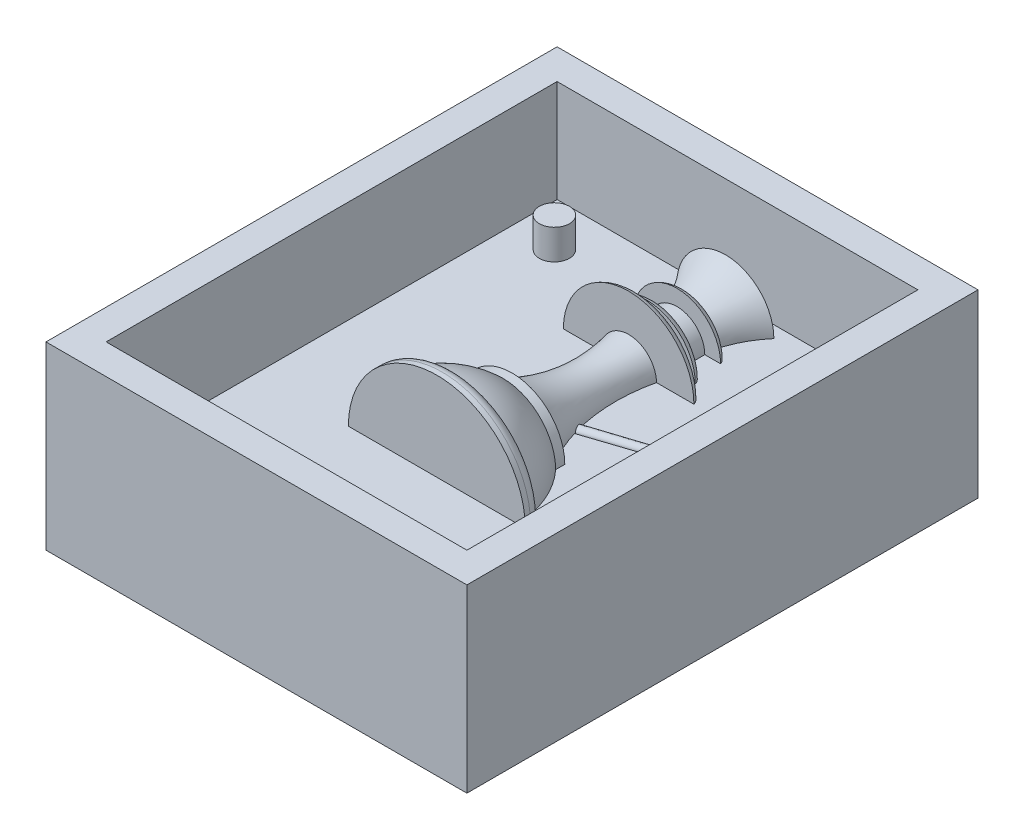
ISO-10303-21;
HEADER;
FILE_DESCRIPTION(('STEP AP214'),'2;1');
FILE_NAME('part.step','',(''),(''),'','','');
FILE_SCHEMA(('AUTOMOTIVE_DESIGN { 1 0 10303 214 1 1 1 1 }'));
ENDSEC;
DATA;
#1=APPLICATION_CONTEXT('core data for automotive mechanical design processes');
#2=APPLICATION_PROTOCOL_DEFINITION('international standard','automotive_design',2000,#1);
#3=PRODUCT_CONTEXT('',#1,'mechanical');
#4=PRODUCT('Part','Part','',(#3));
#5=PRODUCT_RELATED_PRODUCT_CATEGORY('part','',(#4));
#6=PRODUCT_DEFINITION_FORMATION('','',#4);
#7=PRODUCT_DEFINITION_CONTEXT('part definition',#1,'design');
#8=PRODUCT_DEFINITION('design','',#6,#7);
#9=PRODUCT_DEFINITION_SHAPE('','',#8);
#10=(LENGTH_UNIT() NAMED_UNIT(*) SI_UNIT(.MILLI.,.METRE.));
#11=(NAMED_UNIT(*) PLANE_ANGLE_UNIT() SI_UNIT($,.RADIAN.));
#12=(NAMED_UNIT(*) SI_UNIT($,.STERADIAN.) SOLID_ANGLE_UNIT());
#13=UNCERTAINTY_MEASURE_WITH_UNIT(LENGTH_MEASURE(1.E-05),#10,'distance_accuracy_value','');
#14=(GEOMETRIC_REPRESENTATION_CONTEXT(3) GLOBAL_UNCERTAINTY_ASSIGNED_CONTEXT((#13)) GLOBAL_UNIT_ASSIGNED_CONTEXT((#10,
#11,#12)) REPRESENTATION_CONTEXT('',''));
#15=CARTESIAN_POINT('',(0.,0.,0.));
#16=DIRECTION('',(0.,0.,1.));
#17=DIRECTION('',(1.,0.,0.));
#18=AXIS2_PLACEMENT_3D('',#15,#16,#17);
#19=CARTESIAN_POINT('',(0.,13.,0.));
#20=DIRECTION('',(0.,1.,0.));
#21=DIRECTION('',(0.,0.,1.));
#22=AXIS2_PLACEMENT_3D('',#19,#20,#21);
#23=PLANE('',#22);
#24=DIRECTION('',(0.145838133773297,0.,0.989308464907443));
#25=VECTOR('',#24,1.);
#26=CARTESIAN_POINT('',(30.,13.,-14.1966660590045));
#27=LINE('',#26,#25);
#28=CARTESIAN_POINT('',(30.,13.,-14.1966660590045));
#29=VERTEX_POINT('',#28);
#30=CARTESIAN_POINT('',(29.8979133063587,13.,-14.8891819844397));
#31=VERTEX_POINT('',#30);
#32=EDGE_CURVE('E353',#29,#31,#27,.F.);
#33=ORIENTED_EDGE('',*,*,#32,.F.);
#34=DIRECTION('',(0.,0.,-1.));
#35=VECTOR('',#34,1.);
#36=CARTESIAN_POINT('',(30.,13.,37.5));
#37=LINE('',#36,#35);
#38=CARTESIAN_POINT('',(30.,13.,-37.5));
#39=VERTEX_POINT('',#38);
#40=EDGE_CURVE('E349',#29,#39,#37,.T.);
#41=ORIENTED_EDGE('',*,*,#40,.T.);
#42=DIRECTION('',(-1.,0.,0.));
#43=VECTOR('',#42,1.);
#44=CARTESIAN_POINT('',(30.,13.,-37.5));
#45=LINE('',#44,#43);
#46=CARTESIAN_POINT('',(1.76,13.,-37.5));
#47=VERTEX_POINT('',#46);
#48=EDGE_CURVE('E964',#39,#47,#45,.T.);
#49=ORIENTED_EDGE('',*,*,#48,.T.);
#50=DIRECTION('',(0.,0.,-1.));
#51=VECTOR('',#50,1.);
#52=CARTESIAN_POINT('',(1.76,13.,-42.5));
#53=LINE('',#52,#51);
#54=CARTESIAN_POINT('',(1.76,13.,-35.5));
#55=VERTEX_POINT('',#54);
#56=EDGE_CURVE('E313',#47,#55,#53,.F.);
#57=ORIENTED_EDGE('',*,*,#56,.T.);
#58=DIRECTION('',(1.,0.,0.));
#59=VECTOR('',#58,1.);
#60=CARTESIAN_POINT('',(0.,13.,-35.5));
#61=LINE('',#60,#59);
#62=CARTESIAN_POINT('',(8.05528343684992,13.,-35.5));
#63=VERTEX_POINT('',#62);
#64=EDGE_CURVE('E311',#55,#63,#61,.T.);
#65=ORIENTED_EDGE('',*,*,#64,.T.);
#66=CARTESIAN_POINT('',(20.2084994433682,13.,-25.062448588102));
#67=DIRECTION('',(0.,1.,0.));
#68=DIRECTION('',(0.,0.,1.));
#69=AXIS2_PLACEMENT_3D('',#66,#67,#68);
#70=CIRCLE('',#69,16.0200854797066);
#71=CARTESIAN_POINT('',(4.62528343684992,13.,-28.7781608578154));
#72=VERTEX_POINT('',#71);
#73=EDGE_CURVE('E308',#63,#72,#70,.T.);
#74=ORIENTED_EDGE('',*,*,#73,.T.);
#75=DIRECTION('',(1.,0.,0.));
#76=VECTOR('',#75,1.);
#77=CARTESIAN_POINT('',(0.,13.,-28.7781608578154));
#78=LINE('',#77,#76);
#79=CARTESIAN_POINT('',(5.35732157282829,13.,-28.7781608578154));
#80=VERTEX_POINT('',#79);
#81=EDGE_CURVE('E312',#72,#80,#78,.T.);
#82=ORIENTED_EDGE('',*,*,#81,.T.);
#83=CARTESIAN_POINT('',(5.35732157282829,13.,-26.7781608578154));
#84=DIRECTION('',(0.,1.,0.));
#85=DIRECTION('',(0.,0.,1.));
#86=AXIS2_PLACEMENT_3D('',#83,#84,#85);
#87=CIRCLE('',#86,2.);
#88=CARTESIAN_POINT('',(7.24528343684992,13.,-27.4381608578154));
#89=VERTEX_POINT('',#88);
#90=EDGE_CURVE('E56',#80,#89,#87,.F.);
#91=ORIENTED_EDGE('',*,*,#90,.T.);
#92=DIRECTION('',(-1.,0.,0.));
#93=VECTOR('',#92,1.);
#94=CARTESIAN_POINT('',(0.,13.,-27.4381608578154));
#95=LINE('',#94,#93);
#96=CARTESIAN_POINT('',(4.62528343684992,13.,-27.4381608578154));
#97=VERTEX_POINT('',#96);
#98=EDGE_CURVE('E306',#89,#97,#95,.T.);
#99=ORIENTED_EDGE('',*,*,#98,.T.);
#100=DIRECTION('',(0.,0.,-1.));
#101=VECTOR('',#100,1.);
#102=CARTESIAN_POINT('',(4.62528343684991,13.,-42.5));
#103=LINE('',#102,#101);
#104=CARTESIAN_POINT('',(4.62528343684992,13.,-23.8581608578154));
#105=VERTEX_POINT('',#104);
#106=EDGE_CURVE('E303',#97,#105,#103,.F.);
#107=ORIENTED_EDGE('',*,*,#106,.T.);
#108=DIRECTION('',(1.,0.,0.));
#109=VECTOR('',#108,1.);
#110=CARTESIAN_POINT('',(0.,13.,-23.8581608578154));
#111=LINE('',#110,#109);
#112=CARTESIAN_POINT('',(6.13822840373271,13.,-23.8581608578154));
#113=VERTEX_POINT('',#112);
#114=EDGE_CURVE('E307',#105,#113,#111,.T.);
#115=ORIENTED_EDGE('',*,*,#114,.T.);
#116=CARTESIAN_POINT('',(6.13822840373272,13.,-21.8581608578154));
#117=DIRECTION('',(0.,1.,0.));
#118=DIRECTION('',(0.,0.,1.));
#119=AXIS2_PLACEMENT_3D('',#116,#117,#118);
#120=CIRCLE('',#119,2.);
#121=CARTESIAN_POINT('',(8.05528343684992,13.,-22.4281608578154));
#122=VERTEX_POINT('',#121);
#123=EDGE_CURVE('E334',#113,#122,#120,.F.);
#124=ORIENTED_EDGE('',*,*,#123,.T.);
#125=DIRECTION('',(-1.,0.,0.));
#126=VECTOR('',#125,1.);
#127=CARTESIAN_POINT('',(0.,13.,-22.4281608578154));
#128=LINE('',#127,#126);
#129=CARTESIAN_POINT('',(4.62528343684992,13.,-22.4281608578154));
#130=VERTEX_POINT('',#129);
#131=EDGE_CURVE('E302',#122,#130,#128,.T.);
#132=ORIENTED_EDGE('',*,*,#131,.T.);
#133=DIRECTION('',(0.,0.,-1.));
#134=VECTOR('',#133,1.);
#135=CARTESIAN_POINT('',(4.62528343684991,13.,-42.5));
#136=LINE('',#135,#134);
#137=CARTESIAN_POINT('',(4.62528343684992,13.,-20.8281608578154));
#138=VERTEX_POINT('',#137);
#139=EDGE_CURVE('E299',#130,#138,#136,.F.);
#140=ORIENTED_EDGE('',*,*,#139,.T.);
#141=DIRECTION('',(1.,0.,0.));
#142=VECTOR('',#141,1.);
#143=CARTESIAN_POINT('',(0.,13.,-20.8281608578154));
#144=LINE('',#143,#142);
#145=CARTESIAN_POINT('',(8.93822840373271,13.,-20.8281608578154));
#146=VERTEX_POINT('',#145);
#147=EDGE_CURVE('E292',#138,#146,#144,.T.);
#148=ORIENTED_EDGE('',*,*,#147,.T.);
#149=CARTESIAN_POINT('',(8.93822840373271,13.,-18.8281608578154));
#150=DIRECTION('',(0.,1.,0.));
#151=DIRECTION('',(0.,0.,1.));
#152=AXIS2_PLACEMENT_3D('',#149,#150,#151);
#153=CIRCLE('',#152,2.);
#154=CARTESIAN_POINT('',(10.8552834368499,13.,-19.3981608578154));
#155=VERTEX_POINT('',#154);
#156=EDGE_CURVE('E330',#146,#155,#153,.F.);
#157=ORIENTED_EDGE('',*,*,#156,.T.);
#158=DIRECTION('',(-1.,0.,0.));
#159=VECTOR('',#158,1.);
#160=CARTESIAN_POINT('',(0.,13.,-19.3981608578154));
#161=LINE('',#160,#159);
#162=CARTESIAN_POINT('',(4.62528343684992,13.,-19.3981608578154));
#163=VERTEX_POINT('',#162);
#164=EDGE_CURVE('E291',#155,#163,#161,.T.);
#165=ORIENTED_EDGE('',*,*,#164,.T.);
#166=CARTESIAN_POINT('',(31.5891164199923,13.,-13.3029481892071));
#167=DIRECTION('',(0.,1.,0.));
#168=DIRECTION('',(0.,0.,1.));
#169=AXIS2_PLACEMENT_3D('',#166,#167,#168);
#170=CIRCLE('',#169,27.6441658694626);
#171=CARTESIAN_POINT('',(4.93175809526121,13.,-5.9827600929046));
#172=VERTEX_POINT('',#171);
#173=EDGE_CURVE('E282',#163,#172,#170,.T.);
#174=ORIENTED_EDGE('',*,*,#173,.T.);
#175=DIRECTION('',(0.218026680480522,0.,0.975942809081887));
#176=VECTOR('',#175,1.);
#177=CARTESIAN_POINT('',(4.93175809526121,13.,-5.9827600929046));
#178=LINE('',#177,#176);
#179=CARTESIAN_POINT('',(4.76509412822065,13.,-6.72879034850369));
#180=VERTEX_POINT('',#179);
#181=EDGE_CURVE('E41',#180,#172,#178,.T.);
#182=ORIENTED_EDGE('',*,*,#181,.F.);
#183=DIRECTION('',(-0.95112051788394,0.,0.308819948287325));
#184=VECTOR('',#183,1.);
#185=CARTESIAN_POINT('',(274.234734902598,13.,-94.2230657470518));
#186=LINE('',#185,#184);
#187=EDGE_CURVE('E357',#31,#180,#186,.T.);
#188=ORIENTED_EDGE('',*,*,#187,.F.);
#189=EDGE_LOOP('',(#33,#41,#49,#57,#65,#74,#82,#91,#99,#107,#115,#124,#132,#140,#148,#157,#165,
#174,#182,#188));
#190=FACE_BOUND('',#189,.T.);
#191=ADVANCED_FACE('F33',(#190),#23,.T.);
#192=CARTESIAN_POINT('',(0.,0.,0.));
#193=DIRECTION('',(0.,1.,0.));
#194=DIRECTION('',(0.,0.,1.));
#195=AXIS2_PLACEMENT_3D('',#192,#193,#194);
#196=PLANE('',#195);
#197=DIRECTION('',(0.,0.,-1.));
#198=VECTOR('',#197,1.);
#199=CARTESIAN_POINT('',(35.,0.,-42.5));
#200=LINE('',#199,#198);
#201=CARTESIAN_POINT('',(35.,0.,42.5));
#202=VERTEX_POINT('',#201);
#203=CARTESIAN_POINT('',(35.,0.,-42.5));
#204=VERTEX_POINT('',#203);
#205=EDGE_CURVE('E490',#202,#204,#200,.T.);
#206=ORIENTED_EDGE('',*,*,#205,.F.);
#207=DIRECTION('',(1.,0.,0.));
#208=VECTOR('',#207,1.);
#209=CARTESIAN_POINT('',(-35.,0.,42.5));
#210=LINE('',#209,#208);
#211=CARTESIAN_POINT('',(-35.,0.,42.5));
#212=VERTEX_POINT('',#211);
#213=EDGE_CURVE('E861',#212,#202,#210,.T.);
#214=ORIENTED_EDGE('',*,*,#213,.F.);
#215=DIRECTION('',(0.,0.,1.));
#216=VECTOR('',#215,1.);
#217=CARTESIAN_POINT('',(-35.,0.,-42.5));
#218=LINE('',#217,#216);
#219=CARTESIAN_POINT('',(-35.,0.,-42.5));
#220=VERTEX_POINT('',#219);
#221=EDGE_CURVE('E852',#220,#212,#218,.T.);
#222=ORIENTED_EDGE('',*,*,#221,.F.);
#223=DIRECTION('',(-1.,0.,0.));
#224=VECTOR('',#223,1.);
#225=CARTESIAN_POINT('',(-35.,0.,-42.5));
#226=LINE('',#225,#224);
#227=EDGE_CURVE('E849',#204,#220,#226,.T.);
#228=ORIENTED_EDGE('',*,*,#227,.F.);
#229=EDGE_LOOP('',(#206,#214,#222,#228));
#230=FACE_BOUND('',#229,.T.);
#231=DIRECTION('',(-1.,0.,0.));
#232=VECTOR('',#231,1.);
#233=CARTESIAN_POINT('',(0.,0.,12.5));
#234=LINE('',#233,#232);
#235=CARTESIAN_POINT('',(6.8889816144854,0.,12.5));
#236=VERTEX_POINT('',#235);
#237=CARTESIAN_POINT('',(-6.8889816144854,0.,12.5));
#238=VERTEX_POINT('',#237);
#239=EDGE_CURVE('E492',#236,#238,#234,.T.);
#240=ORIENTED_EDGE('',*,*,#239,.F.);
#241=DIRECTION('',(0.,0.,-1.));
#242=VECTOR('',#241,1.);
#243=CARTESIAN_POINT('',(6.88898161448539,0.,-42.5));
#244=LINE('',#243,#242);
#245=CARTESIAN_POINT('',(6.8889816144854,0.,9.6367311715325));
#246=VERTEX_POINT('',#245);
#247=EDGE_CURVE('E494',#246,#236,#244,.F.);
#248=ORIENTED_EDGE('',*,*,#247,.F.);
#249=DIRECTION('',(1.,0.,0.));
#250=VECTOR('',#249,1.);
#251=CARTESIAN_POINT('',(0.,0.,9.63673117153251));
#252=LINE('',#251,#250);
#253=CARTESIAN_POINT('',(1.28522039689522,0.,9.6367311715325));
#254=VERTEX_POINT('',#253);
#255=EDGE_CURVE('E421',#254,#246,#252,.T.);
#256=ORIENTED_EDGE('',*,*,#255,.F.);
#257=CARTESIAN_POINT('',(0.,0.,9.36666581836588));
#258=CARTESIAN_POINT('',(0.192582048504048,0.,9.36668142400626));
#259=CARTESIAN_POINT('',(0.385426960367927,0.,9.38439830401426));
#260=CARTESIAN_POINT('',(0.764982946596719,0.,9.4543302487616));
#261=CARTESIAN_POINT('',(0.951680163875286,0.,9.50661830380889));
#262=CARTESIAN_POINT('',(1.31234993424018,0.,9.64259346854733));
#263=CARTESIAN_POINT('',(1.48637032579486,0.,9.72615435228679));
#264=CARTESIAN_POINT('',(1.81815137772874,0.,9.92070220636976));
#265=CARTESIAN_POINT('',(1.975915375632,0.,10.0316835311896));
#266=CARTESIAN_POINT('',(2.27483005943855,0.,10.2788012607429));
#267=CARTESIAN_POINT('',(2.41564851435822,0.,10.4153373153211));
#268=CARTESIAN_POINT('',(2.67549395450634,0.,10.7077113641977));
#269=CARTESIAN_POINT('',(2.79451412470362,0.,10.8635553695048));
#270=CARTESIAN_POINT('',(3.02329316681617,0.,11.2111819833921));
#271=CARTESIAN_POINT('',(3.12993816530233,0.,11.4050134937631));
#272=CARTESIAN_POINT('',(3.31312290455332,0.,11.8064089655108));
#273=CARTESIAN_POINT('',(3.38964621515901,0.,12.0139803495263));
#274=CARTESIAN_POINT('',(3.51935866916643,0.,12.462972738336));
#275=CARTESIAN_POINT('',(3.5687342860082,0.,12.7054997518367));
#276=CARTESIAN_POINT('',(3.62905168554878,0.,13.1953104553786));
#277=CARTESIAN_POINT('',(3.63997750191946,0.,13.4425960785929));
#278=CARTESIAN_POINT('',(3.62273212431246,0.,13.9533410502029));
#279=CARTESIAN_POINT('',(3.59174946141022,0.,14.2167111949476));
#280=CARTESIAN_POINT('',(3.4857510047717,0.,14.7345569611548));
#281=CARTESIAN_POINT('',(3.41072538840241,0.,14.9890305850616));
#282=CARTESIAN_POINT('',(3.21784308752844,0.,15.4791166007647));
#283=CARTESIAN_POINT('',(3.10031301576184,0.,15.7148565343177));
#284=CARTESIAN_POINT('',(2.82354595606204,0.,16.1606021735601));
#285=CARTESIAN_POINT('',(2.66432882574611,0.,16.370620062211));
#286=CARTESIAN_POINT('',(2.32346245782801,0.,16.7371135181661));
#287=CARTESIAN_POINT('',(2.14520714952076,0.,16.8967323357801));
#288=CARTESIAN_POINT('',(1.760818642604,0.,17.1778895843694));
#289=CARTESIAN_POINT('',(1.55472154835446,0.,17.2994766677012));
#290=CARTESIAN_POINT('',(1.15167511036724,0.,17.4829650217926));
#291=CARTESIAN_POINT('',(0.957427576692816,0.,17.5508087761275));
#292=CARTESIAN_POINT('',(0.55961252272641,0.,17.6484166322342));
#293=CARTESIAN_POINT('',(0.356053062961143,0.,17.6782130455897));
#294=CARTESIAN_POINT('',(-0.0306959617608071,0.,17.6968094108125));
#295=CARTESIAN_POINT('',(-0.213699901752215,0.,17.6897058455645));
#296=CARTESIAN_POINT('',(-0.575739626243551,0.,17.6441930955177));
#297=CARTESIAN_POINT('',(-0.754776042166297,0.,17.6057889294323));
#298=CARTESIAN_POINT('',(-1.10048109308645,0.,17.5006450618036));
#299=CARTESIAN_POINT('',(-1.26732133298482,0.,17.4344643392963));
#300=CARTESIAN_POINT('',(-1.58851058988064,0.,17.2767571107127));
#301=CARTESIAN_POINT('',(-1.74285700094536,0.,17.1852253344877));
#302=CARTESIAN_POINT('',(-2.04607388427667,0.,16.9733009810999));
#303=CARTESIAN_POINT('',(-2.19387034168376,0.,16.8513766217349));
#304=CARTESIAN_POINT('',(-2.46956632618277,0.,16.5868451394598));
#305=CARTESIAN_POINT('',(-2.59745751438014,0.,16.4442293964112));
#306=CARTESIAN_POINT('',(-2.84566286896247,0.,16.1246423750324));
#307=CARTESIAN_POINT('',(-2.96331241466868,0.,15.9456031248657));
#308=CARTESIAN_POINT('',(-3.1707364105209,0.,15.5720740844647));
#309=CARTESIAN_POINT('',(-3.26049725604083,0.,15.3775768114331));
#310=CARTESIAN_POINT('',(-3.42090730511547,0.,14.9530371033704));
#311=CARTESIAN_POINT('',(-3.48781113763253,0.,14.7215762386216));
#312=CARTESIAN_POINT('',(-3.58527835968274,0.,14.251112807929));
#313=CARTESIAN_POINT('',(-3.61582491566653,0.,14.0121068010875));
#314=CARTESIAN_POINT('',(-3.64149301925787,0.,13.5113675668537));
#315=CARTESIAN_POINT('',(-3.63331609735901,0.,13.2494593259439));
#316=CARTESIAN_POINT('',(-3.57387396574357,0.,12.7304885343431));
#317=CARTESIAN_POINT('',(-3.52259596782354,0.,12.4734274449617));
#318=CARTESIAN_POINT('',(-3.3761000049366,0.,11.9678637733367));
#319=CARTESIAN_POINT('',(-3.28023831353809,0.,11.7195459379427));
#320=CARTESIAN_POINT('',(-3.04511476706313,0.,11.2442257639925));
#321=CARTESIAN_POINT('',(-2.90586495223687,0.,11.0172175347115));
#322=CARTESIAN_POINT('',(-2.59734140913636,0.,10.6094223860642));
#323=CARTESIAN_POINT('',(-2.4309100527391,0.,10.4264956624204));
#324=CARTESIAN_POINT('',(-2.06548885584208,0.,10.0964421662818));
#325=CARTESIAN_POINT('',(-1.86652339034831,0.,9.94928879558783));
#326=CARTESIAN_POINT('',(-1.47021709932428,0.,9.71649137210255));
#327=CARTESIAN_POINT('',(-1.2761373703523,0.,9.62528819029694));
#328=CARTESIAN_POINT('',(-0.874284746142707,0.,9.48229022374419));
#329=CARTESIAN_POINT('',(-0.666557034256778,0.,9.43037188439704));
#330=CARTESIAN_POINT('',(-0.380579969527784,0.,9.38872461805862));
#331=CARTESIAN_POINT('',(-0.304715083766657,0.,9.38046545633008));
#332=CARTESIAN_POINT('',(-0.152580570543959,0.,9.36943282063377));
#333=CARTESIAN_POINT('',(-0.0763109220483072,0.,9.36665963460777));
#334=CARTESIAN_POINT('',(0.,0.,9.36666581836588));
#335=B_SPLINE_CURVE_WITH_KNOTS('',3,(#257,#258,#259,#260,#261,#262,#263,#264,#265,#266,#267,
#268,#269,#270,#271,#272,#273,#274,#275,#276,#277,#278,#279,#280,#281,#282,#283,#284,#285,#286,
#287,#288,#289,#290,#291,#292,#293,#294,#295,#296,#297,#298,#299,#300,#301,#302,#303,#304,#305,
#306,#307,#308,#309,#310,#311,#312,#313,#314,#315,#316,#317,#318,#319,#320,#321,#322,#323,#324,
#325,#326,#327,#328,#329,#330,#331,#332,#333,#334),.UNSPECIFIED.,.T.,.F.,(4,2,2,2,2,2,2,2,2,2,2,
2,2,2,2,2,2,2,2,2,2,2,2,2,2,2,2,2,2,2,2,2,2,2,2,2,2,2,4),(0.,0.577410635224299,1.15604427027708,
1.73236713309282,2.30857143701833,2.89468146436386,3.48097442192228,4.14199362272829,
4.80337288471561,5.54270834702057,6.28235078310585,7.07415303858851,7.8661319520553,
8.65215013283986,9.43779457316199,10.1514248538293,10.8641384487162,11.4779130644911,
12.0911660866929,12.6378964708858,13.184539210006,13.7206721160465,14.2569165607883,
14.8293808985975,15.4020844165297,16.0422117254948,16.6826508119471,17.4024325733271,
18.1225474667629,18.9050522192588,19.6877892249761,20.4821964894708,21.2763835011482,
22.0140443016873,22.7511549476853,23.3908400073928,24.0285047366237,24.2572925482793,
24.4860923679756),.UNSPECIFIED.);
#336=CARTESIAN_POINT('',(-1.28522039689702,0.,9.63673117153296));
#337=VERTEX_POINT('',#336);
#338=EDGE_CURVE('E414',#337,#254,#335,.T.);
#339=ORIENTED_EDGE('',*,*,#338,.F.);
#340=CARTESIAN_POINT('',(-6.8889816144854,0.,9.63673117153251));
#341=VERTEX_POINT('',#340);
#342=EDGE_CURVE('E1002',#341,#337,#252,.T.);
#343=ORIENTED_EDGE('',*,*,#342,.F.);
#344=DIRECTION('',(0.,0.,-1.));
#345=VECTOR('',#344,1.);
#346=CARTESIAN_POINT('',(-6.88898161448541,0.,-42.5));
#347=LINE('',#346,#345);
#348=EDGE_CURVE('E497',#238,#341,#347,.T.);
#349=ORIENTED_EDGE('',*,*,#348,.F.);
#350=EDGE_LOOP('',(#240,#248,#256,#339,#343,#349));
#351=FACE_BOUND('',#350,.T.);
#352=ADVANCED_FACE('F423',(#230,#351),#196,.F.);
#353=CARTESIAN_POINT('',(23.,13.,30.5));
#354=DIRECTION('',(0.,1.,0.));
#355=DIRECTION('',(0.,0.,1.));
#356=AXIS2_PLACEMENT_3D('',#353,#354,#355);
#357=CIRCLE('',#356,2.5);
#358=CARTESIAN_POINT('',(23.,13.,33.));
#359=VERTEX_POINT('',#358);
#360=EDGE_CURVE('E1031',#359,#359,#357,.T.);
#361=ORIENTED_EDGE('',*,*,#360,.F.);
#362=EDGE_LOOP('',(#361));
#363=FACE_BOUND('',#362,.T.);
#364=CARTESIAN_POINT('',(-23.,13.,-30.0513648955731));
#365=DIRECTION('',(0.,1.,0.));
#366=DIRECTION('',(0.,0.,1.));
#367=AXIS2_PLACEMENT_3D('',#364,#365,#366);
#368=CIRCLE('',#367,2.5);
#369=CARTESIAN_POINT('',(-23.,13.,-27.5513648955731));
#370=VERTEX_POINT('',#369);
#371=EDGE_CURVE('E1030',#370,#370,#368,.T.);
#372=ORIENTED_EDGE('',*,*,#371,.F.);
#373=EDGE_LOOP('',(#372));
#374=FACE_BOUND('',#373,.T.);
#375=DIRECTION('',(0.949448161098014,0.,-0.313923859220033));
#376=VECTOR('',#375,1.);
#377=CARTESIAN_POINT('',(274.234734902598,13.,-94.2230657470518));
#378=LINE('',#377,#376);
#379=CARTESIAN_POINT('',(5.23890304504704,13.,-5.2827600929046));
#380=VERTEX_POINT('',#379);
#381=CARTESIAN_POINT('',(30.,13.,-13.469725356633));
#382=VERTEX_POINT('',#381);
#383=EDGE_CURVE('E48',#380,#382,#378,.T.);
#384=ORIENTED_EDGE('',*,*,#383,.F.);
#385=DIRECTION('',(0.401801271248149,0.,0.915726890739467));
#386=VECTOR('',#385,1.);
#387=CARTESIAN_POINT('',(4.93175809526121,13.,-5.9827600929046));
#388=LINE('',#387,#386);
#389=EDGE_CURVE('E11',#172,#380,#388,.T.);
#390=ORIENTED_EDGE('',*,*,#389,.F.);
#391=CARTESIAN_POINT('',(7.35625699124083,13.,0.));
#392=VERTEX_POINT('',#391);
#393=EDGE_CURVE('E275',#172,#392,#170,.T.);
#394=ORIENTED_EDGE('',*,*,#393,.T.);
#395=DIRECTION('',(1.,0.,0.));
#396=VECTOR('',#395,1.);
#397=CARTESIAN_POINT('',(0.,13.,0.));
#398=LINE('',#397,#396);
#399=CARTESIAN_POINT('',(8.7791536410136,13.,0.));
#400=VERTEX_POINT('',#399);
#401=EDGE_CURVE('E286',#392,#400,#398,.T.);
#402=ORIENTED_EDGE('',*,*,#401,.T.);
#403=DIRECTION('',(0.,0.,-1.));
#404=VECTOR('',#403,1.);
#405=CARTESIAN_POINT('',(8.77915364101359,13.,-42.5));
#406=LINE('',#405,#404);
#407=CARTESIAN_POINT('',(8.7791536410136,13.,1.52405486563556));
#408=VERTEX_POINT('',#407);
#409=EDGE_CURVE('E297',#400,#408,#406,.F.);
#410=ORIENTED_EDGE('',*,*,#409,.T.);
#411=CARTESIAN_POINT('',(-4.13068325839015,13.,13.5291745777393));
#412=DIRECTION('',(0.,1.,0.));
#413=DIRECTION('',(0.,0.,1.));
#414=AXIS2_PLACEMENT_3D('',#411,#412,#413);
#415=CIRCLE('',#414,17.6291459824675);
#416=CARTESIAN_POINT('',(13.0633759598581,13.,9.6367311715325));
#417=VERTEX_POINT('',#416);
#418=EDGE_CURVE('E919',#408,#417,#415,.F.);
#419=ORIENTED_EDGE('',*,*,#418,.T.);
#420=CARTESIAN_POINT('',(12.7125139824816,13.,11.6057146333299));
#421=DIRECTION('',(0.,1.,0.));
#422=DIRECTION('',(0.,0.,1.));
#423=AXIS2_PLACEMENT_3D('',#420,#421,#422);
#424=CIRCLE('',#423,2.);
#425=CARTESIAN_POINT('',(14.7125139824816,13.,11.6057146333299));
#426=VERTEX_POINT('',#425);
#427=EDGE_CURVE('E318',#417,#426,#424,.F.);
#428=ORIENTED_EDGE('',*,*,#427,.T.);
#429=DIRECTION('',(0.,0.,-1.));
#430=VECTOR('',#429,1.);
#431=CARTESIAN_POINT('',(14.7125139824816,13.,-42.5));
#432=LINE('',#431,#430);
#433=CARTESIAN_POINT('',(14.7125139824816,13.,12.5));
#434=VERTEX_POINT('',#433);
#435=EDGE_CURVE('E918',#426,#434,#432,.F.);
#436=ORIENTED_EDGE('',*,*,#435,.T.);
#437=DIRECTION('',(-1.,0.,0.));
#438=VECTOR('',#437,1.);
#439=CARTESIAN_POINT('',(0.,13.,12.5));
#440=LINE('',#439,#438);
#441=CARTESIAN_POINT('',(-14.7125139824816,13.,12.5));
#442=VERTEX_POINT('',#441);
#443=EDGE_CURVE('E915',#434,#442,#440,.T.);
#444=ORIENTED_EDGE('',*,*,#443,.T.);
#445=DIRECTION('',(0.,0.,-1.));
#446=VECTOR('',#445,1.);
#447=CARTESIAN_POINT('',(-14.7125139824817,13.,-42.5));
#448=LINE('',#447,#446);
#449=CARTESIAN_POINT('',(-14.7125139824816,13.,11.6057146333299));
#450=VERTEX_POINT('',#449);
#451=EDGE_CURVE('E912',#442,#450,#448,.T.);
#452=ORIENTED_EDGE('',*,*,#451,.T.);
#453=CARTESIAN_POINT('',(-12.7125139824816,13.,11.6057146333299));
#454=DIRECTION('',(0.,1.,0.));
#455=DIRECTION('',(0.,0.,1.));
#456=AXIS2_PLACEMENT_3D('',#453,#454,#455);
#457=CIRCLE('',#456,2.);
#458=CARTESIAN_POINT('',(-13.0633759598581,13.,9.6367311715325));
#459=VERTEX_POINT('',#458);
#460=EDGE_CURVE('E320',#450,#459,#457,.F.);
#461=ORIENTED_EDGE('',*,*,#460,.T.);
#462=CARTESIAN_POINT('',(4.13068325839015,13.,13.5291745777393));
#463=DIRECTION('',(0.,1.,0.));
#464=DIRECTION('',(0.,0.,1.));
#465=AXIS2_PLACEMENT_3D('',#462,#463,#464);
#466=CIRCLE('',#465,17.6291459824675);
#467=CARTESIAN_POINT('',(-8.77915364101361,13.,1.52405486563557));
#468=VERTEX_POINT('',#467);
#469=EDGE_CURVE('E909',#459,#468,#466,.F.);
#470=ORIENTED_EDGE('',*,*,#469,.T.);
#471=DIRECTION('',(0.,0.,-1.));
#472=VECTOR('',#471,1.);
#473=CARTESIAN_POINT('',(-8.77915364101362,13.,-42.5));
#474=LINE('',#473,#472);
#475=CARTESIAN_POINT('',(-8.77915364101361,13.,0.));
#476=VERTEX_POINT('',#475);
#477=EDGE_CURVE('E906',#468,#476,#474,.T.);
#478=ORIENTED_EDGE('',*,*,#477,.T.);
#479=CARTESIAN_POINT('',(-7.35625699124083,13.,0.));
#480=VERTEX_POINT('',#479);
#481=EDGE_CURVE('E903',#476,#480,#398,.T.);
#482=ORIENTED_EDGE('',*,*,#481,.T.);
#483=CARTESIAN_POINT('',(-31.5891164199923,13.,-13.3029481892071));
#484=DIRECTION('',(0.,1.,0.));
#485=DIRECTION('',(0.,0.,1.));
#486=AXIS2_PLACEMENT_3D('',#483,#484,#485);
#487=CIRCLE('',#486,27.6441658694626);
#488=CARTESIAN_POINT('',(-4.62528343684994,13.,-19.3981608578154));
#489=VERTEX_POINT('',#488);
#490=EDGE_CURVE('E900',#480,#489,#487,.T.);
#491=ORIENTED_EDGE('',*,*,#490,.T.);
#492=CARTESIAN_POINT('',(-10.8552834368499,13.,-19.3981608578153));
#493=VERTEX_POINT('',#492);
#494=EDGE_CURVE('E294',#489,#493,#161,.T.);
#495=ORIENTED_EDGE('',*,*,#494,.T.);
#496=CARTESIAN_POINT('',(-8.93822840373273,13.,-18.8281608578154));
#497=DIRECTION('',(0.,1.,0.));
#498=DIRECTION('',(0.,0.,1.));
#499=AXIS2_PLACEMENT_3D('',#496,#497,#498);
#500=CIRCLE('',#499,2.);
#501=CARTESIAN_POINT('',(-8.93822840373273,13.,-20.8281608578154));
#502=VERTEX_POINT('',#501);
#503=EDGE_CURVE('E332',#493,#502,#500,.F.);
#504=ORIENTED_EDGE('',*,*,#503,.T.);
#505=CARTESIAN_POINT('',(-4.62528343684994,13.,-20.8281608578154));
#506=VERTEX_POINT('',#505);
#507=EDGE_CURVE('E897',#502,#506,#144,.T.);
#508=ORIENTED_EDGE('',*,*,#507,.T.);
#509=DIRECTION('',(0.,0.,-1.));
#510=VECTOR('',#509,1.);
#511=CARTESIAN_POINT('',(-4.62528343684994,13.,-42.5));
#512=LINE('',#511,#510);
#513=CARTESIAN_POINT('',(-4.62528343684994,13.,-22.4281608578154));
#514=VERTEX_POINT('',#513);
#515=EDGE_CURVE('E894',#506,#514,#512,.T.);
#516=ORIENTED_EDGE('',*,*,#515,.T.);
#517=CARTESIAN_POINT('',(-8.05528343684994,13.,-22.4281608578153));
#518=VERTEX_POINT('',#517);
#519=EDGE_CURVE('E891',#514,#518,#128,.T.);
#520=ORIENTED_EDGE('',*,*,#519,.T.);
#521=CARTESIAN_POINT('',(-6.13822840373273,13.,-21.8581608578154));
#522=DIRECTION('',(0.,1.,0.));
#523=DIRECTION('',(0.,0.,1.));
#524=AXIS2_PLACEMENT_3D('',#521,#522,#523);
#525=CIRCLE('',#524,2.);
#526=CARTESIAN_POINT('',(-6.13822840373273,13.,-23.8581608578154));
#527=VERTEX_POINT('',#526);
#528=EDGE_CURVE('E336',#518,#527,#525,.F.);
#529=ORIENTED_EDGE('',*,*,#528,.T.);
#530=CARTESIAN_POINT('',(-4.62528343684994,13.,-23.8581608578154));
#531=VERTEX_POINT('',#530);
#532=EDGE_CURVE('E889',#527,#531,#111,.T.);
#533=ORIENTED_EDGE('',*,*,#532,.T.);
#534=DIRECTION('',(0.,0.,-1.));
#535=VECTOR('',#534,1.);
#536=CARTESIAN_POINT('',(-4.62528343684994,13.,-42.5));
#537=LINE('',#536,#535);
#538=CARTESIAN_POINT('',(-4.62528343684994,13.,-27.4381608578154));
#539=VERTEX_POINT('',#538);
#540=EDGE_CURVE('E886',#531,#539,#537,.T.);
#541=ORIENTED_EDGE('',*,*,#540,.T.);
#542=CARTESIAN_POINT('',(-7.24528343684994,13.,-27.4381608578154));
#543=VERTEX_POINT('',#542);
#544=EDGE_CURVE('E883',#539,#543,#95,.T.);
#545=ORIENTED_EDGE('',*,*,#544,.T.);
#546=CARTESIAN_POINT('',(-5.35732157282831,13.,-26.7781608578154));
#547=DIRECTION('',(0.,1.,0.));
#548=DIRECTION('',(0.,0.,1.));
#549=AXIS2_PLACEMENT_3D('',#546,#547,#548);
#550=CIRCLE('',#549,2.);
#551=CARTESIAN_POINT('',(-5.35732157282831,13.,-28.7781608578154));
#552=VERTEX_POINT('',#551);
#553=EDGE_CURVE('E339',#543,#552,#550,.F.);
#554=ORIENTED_EDGE('',*,*,#553,.T.);
#555=CARTESIAN_POINT('',(-4.62528343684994,13.,-28.7781608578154));
#556=VERTEX_POINT('',#555);
#557=EDGE_CURVE('E881',#552,#556,#78,.T.);
#558=ORIENTED_EDGE('',*,*,#557,.T.);
#559=CARTESIAN_POINT('',(-20.2084994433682,13.,-25.062448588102));
#560=DIRECTION('',(0.,1.,0.));
#561=DIRECTION('',(0.,0.,1.));
#562=AXIS2_PLACEMENT_3D('',#559,#560,#561);
#563=CIRCLE('',#562,16.0200854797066);
#564=CARTESIAN_POINT('',(-8.05528343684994,13.,-35.5));
#565=VERTEX_POINT('',#564);
#566=EDGE_CURVE('E878',#556,#565,#563,.T.);
#567=ORIENTED_EDGE('',*,*,#566,.T.);
#568=CARTESIAN_POINT('',(-1.76000000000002,13.,-35.5));
#569=VERTEX_POINT('',#568);
#570=EDGE_CURVE('E875',#565,#569,#61,.T.);
#571=ORIENTED_EDGE('',*,*,#570,.T.);
#572=DIRECTION('',(0.,0.,-1.));
#573=VECTOR('',#572,1.);
#574=CARTESIAN_POINT('',(-1.76000000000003,13.,-42.5));
#575=LINE('',#574,#573);
#576=CARTESIAN_POINT('',(-1.76000000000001,13.,-37.5));
#577=VERTEX_POINT('',#576);
#578=EDGE_CURVE('E872',#569,#577,#575,.T.);
#579=ORIENTED_EDGE('',*,*,#578,.T.);
#580=CARTESIAN_POINT('',(-30.,13.,-37.5));
#581=VERTEX_POINT('',#580);
#582=EDGE_CURVE('E959',#577,#581,#45,.T.);
#583=ORIENTED_EDGE('',*,*,#582,.T.);
#584=DIRECTION('',(0.,0.,1.));
#585=VECTOR('',#584,1.);
#586=CARTESIAN_POINT('',(-30.,13.,-37.5));
#587=LINE('',#586,#585);
#588=CARTESIAN_POINT('',(-30.,13.,37.5));
#589=VERTEX_POINT('',#588);
#590=EDGE_CURVE('E967',#581,#589,#587,.T.);
#591=ORIENTED_EDGE('',*,*,#590,.T.);
#592=DIRECTION('',(1.,0.,0.));
#593=VECTOR('',#592,1.);
#594=CARTESIAN_POINT('',(-30.,13.,37.5));
#595=LINE('',#594,#593);
#596=CARTESIAN_POINT('',(30.,13.,37.5));
#597=VERTEX_POINT('',#596);
#598=EDGE_CURVE('E981',#589,#597,#595,.T.);
#599=ORIENTED_EDGE('',*,*,#598,.T.);
#600=EDGE_CURVE('E965',#597,#382,#37,.T.);
#601=ORIENTED_EDGE('',*,*,#600,.T.);
#602=EDGE_LOOP('',(#384,#390,#394,#402,#410,#419,#428,#436,#444,#452,#461,#470,#478,#482,#491,
#495,#504,#508,#516,#520,#529,#533,#541,#545,#554,#558,#567,#571,#579,#583,#591,#599,#601));
#603=FACE_BOUND('',#602,.T.);
#604=ADVANCED_FACE('F273',(#363,#374,#603),#23,.T.);
#605=CARTESIAN_POINT('',(35.,30.,-42.5));
#606=DIRECTION('',(-1.,0.,0.));
#607=DIRECTION('',(0.,0.,1.));
#608=AXIS2_PLACEMENT_3D('',#605,#606,#607);
#609=PLANE('',#608);
#610=ORIENTED_EDGE('',*,*,#205,.T.);
#611=DIRECTION('',(0.,-1.,0.));
#612=VECTOR('',#611,1.);
#613=CARTESIAN_POINT('',(35.,30.,-42.5));
#614=LINE('',#613,#612);
#615=CARTESIAN_POINT('',(35.,30.,-42.5));
#616=VERTEX_POINT('',#615);
#617=EDGE_CURVE('E846',#616,#204,#614,.T.);
#618=ORIENTED_EDGE('',*,*,#617,.F.);
#619=DIRECTION('',(0.,0.,-1.));
#620=VECTOR('',#619,1.);
#621=CARTESIAN_POINT('',(35.,30.,-42.5));
#622=LINE('',#621,#620);
#623=CARTESIAN_POINT('',(35.,30.,42.5));
#624=VERTEX_POINT('',#623);
#625=EDGE_CURVE('E863',#624,#616,#622,.T.);
#626=ORIENTED_EDGE('',*,*,#625,.F.);
#627=DIRECTION('',(0.,-1.,0.));
#628=VECTOR('',#627,1.);
#629=CARTESIAN_POINT('',(35.,30.,42.5));
#630=LINE('',#629,#628);
#631=EDGE_CURVE('E848',#624,#202,#630,.T.);
#632=ORIENTED_EDGE('',*,*,#631,.T.);
#633=EDGE_LOOP('',(#610,#618,#626,#632));
#634=FACE_BOUND('',#633,.T.);
#635=ADVANCED_FACE('F452',(#634),#609,.F.);
#636=CARTESIAN_POINT('',(-35.,30.,-42.5));
#637=DIRECTION('',(0.,0.,1.));
#638=DIRECTION('',(1.,0.,0.));
#639=AXIS2_PLACEMENT_3D('',#636,#637,#638);
#640=PLANE('',#639);
#641=ORIENTED_EDGE('',*,*,#227,.T.);
#642=DIRECTION('',(0.,-1.,0.));
#643=VECTOR('',#642,1.);
#644=CARTESIAN_POINT('',(-35.,30.,-42.5));
#645=LINE('',#644,#643);
#646=CARTESIAN_POINT('',(-35.,30.,-42.5));
#647=VERTEX_POINT('',#646);
#648=EDGE_CURVE('E868',#647,#220,#645,.T.);
#649=ORIENTED_EDGE('',*,*,#648,.F.);
#650=DIRECTION('',(-1.,0.,0.));
#651=VECTOR('',#650,1.);
#652=CARTESIAN_POINT('',(-35.,30.,-42.5));
#653=LINE('',#652,#651);
#654=EDGE_CURVE('E990',#616,#647,#653,.T.);
#655=ORIENTED_EDGE('',*,*,#654,.F.);
#656=ORIENTED_EDGE('',*,*,#617,.T.);
#657=EDGE_LOOP('',(#641,#649,#655,#656));
#658=FACE_BOUND('',#657,.T.);
#659=ADVANCED_FACE('F818',(#658),#640,.F.);
#660=CARTESIAN_POINT('',(-35.,30.,-42.5));
#661=DIRECTION('',(1.,0.,0.));
#662=DIRECTION('',(0.,0.,-1.));
#663=AXIS2_PLACEMENT_3D('',#660,#661,#662);
#664=PLANE('',#663);
#665=ORIENTED_EDGE('',*,*,#221,.T.);
#666=DIRECTION('',(0.,-1.,0.));
#667=VECTOR('',#666,1.);
#668=CARTESIAN_POINT('',(-35.,30.,42.5));
#669=LINE('',#668,#667);
#670=CARTESIAN_POINT('',(-35.,30.,42.5));
#671=VERTEX_POINT('',#670);
#672=EDGE_CURVE('E865',#671,#212,#669,.T.);
#673=ORIENTED_EDGE('',*,*,#672,.F.);
#674=DIRECTION('',(0.,0.,1.));
#675=VECTOR('',#674,1.);
#676=CARTESIAN_POINT('',(-35.,30.,-42.5));
#677=LINE('',#676,#675);
#678=EDGE_CURVE('E991',#647,#671,#677,.T.);
#679=ORIENTED_EDGE('',*,*,#678,.F.);
#680=ORIENTED_EDGE('',*,*,#648,.T.);
#681=EDGE_LOOP('',(#665,#673,#679,#680));
#682=FACE_BOUND('',#681,.T.);
#683=ADVANCED_FACE('F475',(#682),#664,.F.);
#684=CARTESIAN_POINT('',(-35.,30.,42.5));
#685=DIRECTION('',(0.,0.,-1.));
#686=DIRECTION('',(-1.,0.,0.));
#687=AXIS2_PLACEMENT_3D('',#684,#685,#686);
#688=PLANE('',#687);
#689=ORIENTED_EDGE('',*,*,#213,.T.);
#690=ORIENTED_EDGE('',*,*,#631,.F.);
#691=DIRECTION('',(1.,0.,0.));
#692=VECTOR('',#691,1.);
#693=CARTESIAN_POINT('',(-35.,30.,42.5));
#694=LINE('',#693,#692);
#695=EDGE_CURVE('E857',#671,#624,#694,.T.);
#696=ORIENTED_EDGE('',*,*,#695,.F.);
#697=ORIENTED_EDGE('',*,*,#672,.T.);
#698=EDGE_LOOP('',(#689,#690,#696,#697));
#699=FACE_BOUND('',#698,.T.);
#700=ADVANCED_FACE('F470',(#699),#688,.F.);
#701=CARTESIAN_POINT('',(0.,30.,0.));
#702=DIRECTION('',(0.,1.,0.));
#703=DIRECTION('',(0.,0.,1.));
#704=AXIS2_PLACEMENT_3D('',#701,#702,#703);
#705=PLANE('',#704);
#706=DIRECTION('',(1.,0.,0.));
#707=VECTOR('',#706,1.);
#708=CARTESIAN_POINT('',(-30.,30.,37.5));
#709=LINE('',#708,#707);
#710=CARTESIAN_POINT('',(-30.,30.,37.5));
#711=VERTEX_POINT('',#710);
#712=CARTESIAN_POINT('',(30.,30.,37.5));
#713=VERTEX_POINT('',#712);
#714=EDGE_CURVE('E501',#711,#713,#709,.T.);
#715=ORIENTED_EDGE('',*,*,#714,.F.);
#716=DIRECTION('',(0.,0.,1.));
#717=VECTOR('',#716,1.);
#718=CARTESIAN_POINT('',(-30.,30.,-37.5));
#719=LINE('',#718,#717);
#720=CARTESIAN_POINT('',(-30.,30.,-37.5));
#721=VERTEX_POINT('',#720);
#722=EDGE_CURVE('E979',#721,#711,#719,.T.);
#723=ORIENTED_EDGE('',*,*,#722,.F.);
#724=DIRECTION('',(-1.,0.,0.));
#725=VECTOR('',#724,1.);
#726=CARTESIAN_POINT('',(30.,30.,-37.5));
#727=LINE('',#726,#725);
#728=CARTESIAN_POINT('',(30.,30.,-37.5));
#729=VERTEX_POINT('',#728);
#730=EDGE_CURVE('E977',#729,#721,#727,.T.);
#731=ORIENTED_EDGE('',*,*,#730,.F.);
#732=DIRECTION('',(0.,0.,-1.));
#733=VECTOR('',#732,1.);
#734=CARTESIAN_POINT('',(30.,30.,37.5));
#735=LINE('',#734,#733);
#736=EDGE_CURVE('E974',#713,#729,#735,.T.);
#737=ORIENTED_EDGE('',*,*,#736,.F.);
#738=EDGE_LOOP('',(#715,#723,#731,#737));
#739=FACE_BOUND('',#738,.T.);
#740=ORIENTED_EDGE('',*,*,#625,.T.);
#741=ORIENTED_EDGE('',*,*,#654,.T.);
#742=ORIENTED_EDGE('',*,*,#678,.T.);
#743=ORIENTED_EDGE('',*,*,#695,.T.);
#744=EDGE_LOOP('',(#740,#741,#742,#743));
#745=FACE_BOUND('',#744,.T.);
#746=ADVANCED_FACE('F467',(#739,#745),#705,.T.);
#747=CARTESIAN_POINT('',(-30.,13.,37.5));
#748=DIRECTION('',(0.,0.,1.));
#749=DIRECTION('',(1.,0.,0.));
#750=AXIS2_PLACEMENT_3D('',#747,#748,#749);
#751=PLANE('',#750);
#752=ORIENTED_EDGE('',*,*,#714,.T.);
#753=DIRECTION('',(0.,1.,0.));
#754=VECTOR('',#753,1.);
#755=CARTESIAN_POINT('',(30.,13.,37.5));
#756=LINE('',#755,#754);
#757=EDGE_CURVE('E972',#597,#713,#756,.T.);
#758=ORIENTED_EDGE('',*,*,#757,.F.);
#759=ORIENTED_EDGE('',*,*,#598,.F.);
#760=DIRECTION('',(0.,1.,0.));
#761=VECTOR('',#760,1.);
#762=CARTESIAN_POINT('',(-30.,13.,37.5));
#763=LINE('',#762,#761);
#764=EDGE_CURVE('E850',#589,#711,#763,.T.);
#765=ORIENTED_EDGE('',*,*,#764,.T.);
#766=EDGE_LOOP('',(#752,#758,#759,#765));
#767=FACE_BOUND('',#766,.T.);
#768=ADVANCED_FACE('F458',(#767),#751,.F.);
#769=CARTESIAN_POINT('',(-30.,13.,-37.5));
#770=DIRECTION('',(-1.,0.,0.));
#771=DIRECTION('',(0.,0.,1.));
#772=AXIS2_PLACEMENT_3D('',#769,#770,#771);
#773=PLANE('',#772);
#774=ORIENTED_EDGE('',*,*,#722,.T.);
#775=ORIENTED_EDGE('',*,*,#764,.F.);
#776=ORIENTED_EDGE('',*,*,#590,.F.);
#777=DIRECTION('',(0.,1.,0.));
#778=VECTOR('',#777,1.);
#779=CARTESIAN_POINT('',(-30.,13.,-37.5));
#780=LINE('',#779,#778);
#781=EDGE_CURVE('E854',#581,#721,#780,.T.);
#782=ORIENTED_EDGE('',*,*,#781,.T.);
#783=EDGE_LOOP('',(#774,#775,#776,#782));
#784=FACE_BOUND('',#783,.T.);
#785=ADVANCED_FACE('F454',(#784),#773,.F.);
#786=CARTESIAN_POINT('',(30.,13.,-37.5));
#787=DIRECTION('',(0.,0.,-1.));
#788=DIRECTION('',(-1.,0.,0.));
#789=AXIS2_PLACEMENT_3D('',#786,#787,#788);
#790=PLANE('',#789);
#791=CARTESIAN_POINT('',(0.,13.,-37.5));
#792=DIRECTION('',(0.,0.,-1.));
#793=DIRECTION('',(-1.,0.,0.));
#794=AXIS2_PLACEMENT_3D('',#791,#792,#793);
#795=CIRCLE('',#794,1.76000000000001);
#796=EDGE_CURVE('E358',#577,#47,#795,.T.);
#797=ORIENTED_EDGE('',*,*,#796,.T.);
#798=ORIENTED_EDGE('',*,*,#48,.F.);
#799=DIRECTION('',(0.,1.,0.));
#800=VECTOR('',#799,1.);
#801=CARTESIAN_POINT('',(30.,13.,-37.5));
#802=LINE('',#801,#800);
#803=EDGE_CURVE('E984',#39,#729,#802,.T.);
#804=ORIENTED_EDGE('',*,*,#803,.T.);
#805=ORIENTED_EDGE('',*,*,#730,.T.);
#806=ORIENTED_EDGE('',*,*,#781,.F.);
#807=ORIENTED_EDGE('',*,*,#582,.F.);
#808=EDGE_LOOP('',(#797,#798,#804,#805,#806,#807));
#809=FACE_BOUND('',#808,.T.);
#810=ADVANCED_FACE('F457',(#809),#790,.F.);
#811=CARTESIAN_POINT('',(30.,13.,37.5));
#812=DIRECTION('',(1.,0.,0.));
#813=DIRECTION('',(0.,0.,-1.));
#814=AXIS2_PLACEMENT_3D('',#811,#812,#813);
#815=PLANE('',#814);
#816=ORIENTED_EDGE('',*,*,#40,.F.);
#817=DIRECTION('',(0.,-0.838941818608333,0.544221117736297));
#818=VECTOR('',#817,1.);
#819=CARTESIAN_POINT('',(30.,13.,-14.1966660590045));
#820=LINE('',#819,#818);
#821=CARTESIAN_POINT('',(30.,13.5872592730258,-14.57762084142));
#822=VERTEX_POINT('',#821);
#823=EDGE_CURVE('E270',#29,#822,#820,.F.);
#824=ORIENTED_EDGE('',*,*,#823,.T.);
#825=CARTESIAN_POINT('',(30.,13.,-14.1960269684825));
#826=DIRECTION('',(1.,0.,0.));
#827=DIRECTION('',(0.,0.,1.));
#828=AXIS2_PLACEMENT_3D('',#825,#826,#827);
#829=ELLIPSE('',#828,0.726301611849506,0.690195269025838);
#830=EDGE_CURVE('E341',#822,#382,#829,.T.);
#831=ORIENTED_EDGE('',*,*,#830,.T.);
#832=ORIENTED_EDGE('',*,*,#600,.F.);
#833=ORIENTED_EDGE('',*,*,#757,.T.);
#834=ORIENTED_EDGE('',*,*,#736,.T.);
#835=ORIENTED_EDGE('',*,*,#803,.F.);
#836=EDGE_LOOP('',(#816,#824,#831,#832,#833,#834,#835));
#837=FACE_BOUND('',#836,.T.);
#838=ADVANCED_FACE('F346',(#837),#815,.F.);
#839=CARTESIAN_POINT('',(0.,13.,-42.5));
#840=DIRECTION('',(0.,0.,-1.));
#841=DIRECTION('',(-1.,0.,0.));
#842=AXIS2_PLACEMENT_3D('',#839,#840,#841);
#843=CYLINDRICAL_SURFACE('',#842,1.76000000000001);
#844=ORIENTED_EDGE('',*,*,#56,.F.);
#845=ORIENTED_EDGE('',*,*,#796,.F.);
#846=ORIENTED_EDGE('',*,*,#578,.F.);
#847=CARTESIAN_POINT('',(0.,13.,-35.5));
#848=DIRECTION('',(0.,0.,-1.));
#849=DIRECTION('',(-1.,0.,0.));
#850=AXIS2_PLACEMENT_3D('',#847,#848,#849);
#851=CIRCLE('',#850,1.76000000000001);
#852=EDGE_CURVE('E361',#569,#55,#851,.T.);
#853=ORIENTED_EDGE('',*,*,#852,.T.);
#854=EDGE_LOOP('',(#844,#845,#846,#853));
#855=FACE_BOUND('',#854,.T.);
#856=ADVANCED_FACE('F465',(#855),#843,.T.);
#857=CARTESIAN_POINT('',(1.76,13.,-35.5));
#858=DIRECTION('',(0.,0.,1.));
#859=DIRECTION('',(1.,0.,0.));
#860=AXIS2_PLACEMENT_3D('',#857,#858,#859);
#861=PLANE('',#860);
#862=ORIENTED_EDGE('',*,*,#570,.F.);
#863=CARTESIAN_POINT('',(0.,13.,-35.5));
#864=DIRECTION('',(0.,0.,-1.));
#865=DIRECTION('',(-1.,0.,0.));
#866=AXIS2_PLACEMENT_3D('',#863,#864,#865);
#867=CIRCLE('',#866,8.05528343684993);
#868=EDGE_CURVE('E368',#565,#63,#867,.T.);
#869=ORIENTED_EDGE('',*,*,#868,.T.);
#870=ORIENTED_EDGE('',*,*,#64,.F.);
#871=ORIENTED_EDGE('',*,*,#852,.F.);
#872=EDGE_LOOP('',(#862,#869,#870,#871));
#873=FACE_BOUND('',#872,.T.);
#874=ADVANCED_FACE('F757',(#873),#861,.F.);
#875=CARTESIAN_POINT('',(0.,13.,-25.062448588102));
#876=DIRECTION('',(0.,0.,-1.));
#877=DIRECTION('',(-1.,0.,0.));
#878=AXIS2_PLACEMENT_3D('',#875,#876,#877);
#879=TOROIDAL_SURFACE('',#878,20.2084994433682,16.0200854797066);
#880=ORIENTED_EDGE('',*,*,#73,.F.);
#881=ORIENTED_EDGE('',*,*,#868,.F.);
#882=ORIENTED_EDGE('',*,*,#566,.F.);
#883=CARTESIAN_POINT('',(0.,13.,-28.7781608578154));
#884=DIRECTION('',(0.,0.,-1.));
#885=DIRECTION('',(-1.,0.,0.));
#886=AXIS2_PLACEMENT_3D('',#883,#884,#885);
#887=CIRCLE('',#886,4.62528343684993);
#888=EDGE_CURVE('E371',#556,#72,#887,.T.);
#889=ORIENTED_EDGE('',*,*,#888,.T.);
#890=EDGE_LOOP('',(#880,#881,#882,#889));
#891=FACE_BOUND('',#890,.T.);
#892=ADVANCED_FACE('F749',(#891),#879,.F.);
#893=CARTESIAN_POINT('',(4.62528343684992,13.,-28.7781608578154));
#894=DIRECTION('',(0.,0.,1.));
#895=DIRECTION('',(1.,0.,0.));
#896=AXIS2_PLACEMENT_3D('',#893,#894,#895);
#897=PLANE('',#896);
#898=ORIENTED_EDGE('',*,*,#557,.F.);
#899=CARTESIAN_POINT('',(0.,13.,-28.7781608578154));
#900=DIRECTION('',(0.,0.,1.));
#901=DIRECTION('',(1.,0.,0.));
#902=AXIS2_PLACEMENT_3D('',#899,#900,#901);
#903=CIRCLE('',#902,5.3573215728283);
#904=EDGE_CURVE('E328',#552,#80,#903,.F.);
#905=ORIENTED_EDGE('',*,*,#904,.T.);
#906=ORIENTED_EDGE('',*,*,#81,.F.);
#907=ORIENTED_EDGE('',*,*,#888,.F.);
#908=EDGE_LOOP('',(#898,#905,#906,#907));
#909=FACE_BOUND('',#908,.T.);
#910=ADVANCED_FACE('F741',(#909),#897,.F.);
#911=CARTESIAN_POINT('',(7.24528343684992,13.,-27.4381608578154));
#912=DIRECTION('',(0.,0.,-1.));
#913=DIRECTION('',(-1.,0.,0.));
#914=AXIS2_PLACEMENT_3D('',#911,#912,#913);
#915=PLANE('',#914);
#916=ORIENTED_EDGE('',*,*,#98,.F.);
#917=CARTESIAN_POINT('',(0.,13.,-27.4381608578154));
#918=DIRECTION('',(0.,0.,-1.));
#919=DIRECTION('',(-1.,0.,0.));
#920=AXIS2_PLACEMENT_3D('',#917,#918,#919);
#921=CIRCLE('',#920,7.24528343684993);
#922=EDGE_CURVE('E374',#543,#89,#921,.T.);
#923=ORIENTED_EDGE('',*,*,#922,.F.);
#924=ORIENTED_EDGE('',*,*,#544,.F.);
#925=CARTESIAN_POINT('',(0.,13.,-27.4381608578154));
#926=DIRECTION('',(0.,0.,-1.));
#927=DIRECTION('',(-1.,0.,0.));
#928=AXIS2_PLACEMENT_3D('',#925,#926,#927);
#929=CIRCLE('',#928,4.62528343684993);
#930=EDGE_CURVE('E376',#539,#97,#929,.T.);
#931=ORIENTED_EDGE('',*,*,#930,.T.);
#932=EDGE_LOOP('',(#916,#923,#924,#931));
#933=FACE_BOUND('',#932,.T.);
#934=ADVANCED_FACE('F732',(#933),#915,.F.);
#935=CARTESIAN_POINT('',(0.,13.,-42.5));
#936=DIRECTION('',(0.,0.,-1.));
#937=DIRECTION('',(-1.,0.,0.));
#938=AXIS2_PLACEMENT_3D('',#935,#936,#937);
#939=CYLINDRICAL_SURFACE('',#938,4.62528343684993);
#940=ORIENTED_EDGE('',*,*,#106,.F.);
#941=ORIENTED_EDGE('',*,*,#930,.F.);
#942=ORIENTED_EDGE('',*,*,#540,.F.);
#943=CARTESIAN_POINT('',(0.,13.,-23.8581608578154));
#944=DIRECTION('',(0.,0.,-1.));
#945=DIRECTION('',(-1.,0.,0.));
#946=AXIS2_PLACEMENT_3D('',#943,#944,#945);
#947=CIRCLE('',#946,4.62528343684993);
#948=EDGE_CURVE('E379',#531,#105,#947,.T.);
#949=ORIENTED_EDGE('',*,*,#948,.T.);
#950=EDGE_LOOP('',(#940,#941,#942,#949));
#951=FACE_BOUND('',#950,.T.);
#952=ADVANCED_FACE('F723',(#951),#939,.T.);
#953=CARTESIAN_POINT('',(4.62528343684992,13.,-23.8581608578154));
#954=DIRECTION('',(0.,0.,1.));
#955=DIRECTION('',(1.,0.,0.));
#956=AXIS2_PLACEMENT_3D('',#953,#954,#955);
#957=PLANE('',#956);
#958=ORIENTED_EDGE('',*,*,#532,.F.);
#959=CARTESIAN_POINT('',(0.,13.,-23.8581608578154));
#960=DIRECTION('',(0.,0.,1.));
#961=DIRECTION('',(1.,0.,0.));
#962=AXIS2_PLACEMENT_3D('',#959,#960,#961);
#963=CIRCLE('',#962,6.13822840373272);
#964=EDGE_CURVE('E325',#527,#113,#963,.F.);
#965=ORIENTED_EDGE('',*,*,#964,.T.);
#966=ORIENTED_EDGE('',*,*,#114,.F.);
#967=ORIENTED_EDGE('',*,*,#948,.F.);
#968=EDGE_LOOP('',(#958,#965,#966,#967));
#969=FACE_BOUND('',#968,.T.);
#970=ADVANCED_FACE('F714',(#969),#957,.F.);
#971=CARTESIAN_POINT('',(8.05528343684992,13.,-22.4281608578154));
#972=DIRECTION('',(0.,0.,-1.));
#973=DIRECTION('',(-1.,0.,0.));
#974=AXIS2_PLACEMENT_3D('',#971,#972,#973);
#975=PLANE('',#974);
#976=ORIENTED_EDGE('',*,*,#131,.F.);
#977=CARTESIAN_POINT('',(0.,13.,-22.4281608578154));
#978=DIRECTION('',(0.,0.,-1.));
#979=DIRECTION('',(-1.,0.,0.));
#980=AXIS2_PLACEMENT_3D('',#977,#978,#979);
#981=CIRCLE('',#980,8.05528343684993);
#982=EDGE_CURVE('E382',#518,#122,#981,.T.);
#983=ORIENTED_EDGE('',*,*,#982,.F.);
#984=ORIENTED_EDGE('',*,*,#519,.F.);
#985=CARTESIAN_POINT('',(0.,13.,-22.4281608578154));
#986=DIRECTION('',(0.,0.,-1.));
#987=DIRECTION('',(-1.,0.,0.));
#988=AXIS2_PLACEMENT_3D('',#985,#986,#987);
#989=CIRCLE('',#988,4.62528343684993);
#990=EDGE_CURVE('E385',#514,#130,#989,.T.);
#991=ORIENTED_EDGE('',*,*,#990,.T.);
#992=EDGE_LOOP('',(#976,#983,#984,#991));
#993=FACE_BOUND('',#992,.T.);
#994=ADVANCED_FACE('F705',(#993),#975,.F.);
#995=CARTESIAN_POINT('',(0.,13.,-42.5));
#996=DIRECTION('',(0.,0.,-1.));
#997=DIRECTION('',(-1.,0.,0.));
#998=AXIS2_PLACEMENT_3D('',#995,#996,#997);
#999=CYLINDRICAL_SURFACE('',#998,4.62528343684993);
#1000=ORIENTED_EDGE('',*,*,#139,.F.);
#1001=ORIENTED_EDGE('',*,*,#990,.F.);
#1002=ORIENTED_EDGE('',*,*,#515,.F.);
#1003=CARTESIAN_POINT('',(0.,13.,-20.8281608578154));
#1004=DIRECTION('',(0.,0.,-1.));
#1005=DIRECTION('',(-1.,0.,0.));
#1006=AXIS2_PLACEMENT_3D('',#1003,#1004,#1005);
#1007=CIRCLE('',#1006,4.62528343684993);
#1008=EDGE_CURVE('E388',#506,#138,#1007,.T.);
#1009=ORIENTED_EDGE('',*,*,#1008,.T.);
#1010=EDGE_LOOP('',(#1000,#1001,#1002,#1009));
#1011=FACE_BOUND('',#1010,.T.);
#1012=ADVANCED_FACE('F696',(#1011),#999,.T.);
#1013=CARTESIAN_POINT('',(4.62528343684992,13.,-20.8281608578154));
#1014=DIRECTION('',(0.,0.,1.));
#1015=DIRECTION('',(1.,0.,0.));
#1016=AXIS2_PLACEMENT_3D('',#1013,#1014,#1015);
#1017=PLANE('',#1016);
#1018=ORIENTED_EDGE('',*,*,#507,.F.);
#1019=CARTESIAN_POINT('',(0.,13.,-20.8281608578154));
#1020=DIRECTION('',(0.,0.,1.));
#1021=DIRECTION('',(1.,0.,0.));
#1022=AXIS2_PLACEMENT_3D('',#1019,#1020,#1021);
#1023=CIRCLE('',#1022,8.93822840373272);
#1024=EDGE_CURVE('E322',#502,#146,#1023,.F.);
#1025=ORIENTED_EDGE('',*,*,#1024,.T.);
#1026=ORIENTED_EDGE('',*,*,#147,.F.);
#1027=ORIENTED_EDGE('',*,*,#1008,.F.);
#1028=EDGE_LOOP('',(#1018,#1025,#1026,#1027));
#1029=FACE_BOUND('',#1028,.T.);
#1030=ADVANCED_FACE('F687',(#1029),#1017,.F.);
#1031=CARTESIAN_POINT('',(10.8552834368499,13.,-19.3981608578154));
#1032=DIRECTION('',(0.,0.,-1.));
#1033=DIRECTION('',(-1.,0.,0.));
#1034=AXIS2_PLACEMENT_3D('',#1031,#1032,#1033);
#1035=PLANE('',#1034);
#1036=ORIENTED_EDGE('',*,*,#164,.F.);
#1037=CARTESIAN_POINT('',(0.,13.,-19.3981608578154));
#1038=DIRECTION('',(0.,0.,-1.));
#1039=DIRECTION('',(-1.,0.,0.));
#1040=AXIS2_PLACEMENT_3D('',#1037,#1038,#1039);
#1041=CIRCLE('',#1040,10.8552834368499);
#1042=EDGE_CURVE('E391',#493,#155,#1041,.T.);
#1043=ORIENTED_EDGE('',*,*,#1042,.F.);
#1044=ORIENTED_EDGE('',*,*,#494,.F.);
#1045=CARTESIAN_POINT('',(0.,13.,-19.3981608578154));
#1046=DIRECTION('',(0.,0.,-1.));
#1047=DIRECTION('',(-1.,0.,0.));
#1048=AXIS2_PLACEMENT_3D('',#1045,#1046,#1047);
#1049=CIRCLE('',#1048,4.62528343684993);
#1050=EDGE_CURVE('E394',#489,#163,#1049,.T.);
#1051=ORIENTED_EDGE('',*,*,#1050,.T.);
#1052=EDGE_LOOP('',(#1036,#1043,#1044,#1051));
#1053=FACE_BOUND('',#1052,.T.);
#1054=ADVANCED_FACE('F680',(#1053),#1035,.F.);
#1055=CARTESIAN_POINT('',(0.,13.,-13.3029481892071));
#1056=DIRECTION('',(0.,0.,-1.));
#1057=DIRECTION('',(-1.,0.,0.));
#1058=AXIS2_PLACEMENT_3D('',#1055,#1056,#1057);
#1059=TOROIDAL_SURFACE('',#1058,31.5891164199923,27.6441658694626);
#1060=ORIENTED_EDGE('',*,*,#173,.F.);
#1061=ORIENTED_EDGE('',*,*,#1050,.F.);
#1062=ORIENTED_EDGE('',*,*,#490,.F.);
#1063=CARTESIAN_POINT('',(0.,13.,0.));
#1064=DIRECTION('',(0.,0.,-1.));
#1065=DIRECTION('',(-1.,0.,0.));
#1066=AXIS2_PLACEMENT_3D('',#1063,#1064,#1065);
#1067=CIRCLE('',#1066,7.35625699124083);
#1068=EDGE_CURVE('E285',#480,#392,#1067,.T.);
#1069=ORIENTED_EDGE('',*,*,#1068,.T.);
#1070=ORIENTED_EDGE('',*,*,#393,.F.);
#1071=EDGE_LOOP('',(#1060,#1061,#1062,#1069,#1070));
#1072=FACE_BOUND('',#1071,.T.);
#1073=ADVANCED_FACE('F280',(#1072),#1059,.F.);
#1074=CARTESIAN_POINT('',(7.35625699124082,13.,0.));
#1075=DIRECTION('',(0.,0.,1.));
#1076=DIRECTION('',(1.,0.,0.));
#1077=AXIS2_PLACEMENT_3D('',#1074,#1075,#1076);
#1078=PLANE('',#1077);
#1079=ORIENTED_EDGE('',*,*,#481,.F.);
#1080=CARTESIAN_POINT('',(0.,13.,0.));
#1081=DIRECTION('',(0.,0.,-1.));
#1082=DIRECTION('',(-1.,0.,0.));
#1083=AXIS2_PLACEMENT_3D('',#1080,#1081,#1082);
#1084=CIRCLE('',#1083,8.7791536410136);
#1085=EDGE_CURVE('E397',#476,#400,#1084,.T.);
#1086=ORIENTED_EDGE('',*,*,#1085,.T.);
#1087=ORIENTED_EDGE('',*,*,#401,.F.);
#1088=ORIENTED_EDGE('',*,*,#1068,.F.);
#1089=EDGE_LOOP('',(#1079,#1086,#1087,#1088));
#1090=FACE_BOUND('',#1089,.T.);
#1091=ADVANCED_FACE('F665',(#1090),#1078,.F.);
#1092=CARTESIAN_POINT('',(0.,13.,-42.5));
#1093=DIRECTION('',(0.,0.,-1.));
#1094=DIRECTION('',(-1.,0.,0.));
#1095=AXIS2_PLACEMENT_3D('',#1092,#1093,#1094);
#1096=CYLINDRICAL_SURFACE('',#1095,8.7791536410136);
#1097=ORIENTED_EDGE('',*,*,#409,.F.);
#1098=ORIENTED_EDGE('',*,*,#1085,.F.);
#1099=ORIENTED_EDGE('',*,*,#477,.F.);
#1100=CARTESIAN_POINT('',(0.,13.,1.52405486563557));
#1101=DIRECTION('',(0.,0.,-1.));
#1102=DIRECTION('',(-1.,0.,0.));
#1103=AXIS2_PLACEMENT_3D('',#1100,#1101,#1102);
#1104=CIRCLE('',#1103,8.7791536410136);
#1105=EDGE_CURVE('E400',#468,#408,#1104,.T.);
#1106=ORIENTED_EDGE('',*,*,#1105,.T.);
#1107=EDGE_LOOP('',(#1097,#1098,#1099,#1106));
#1108=FACE_BOUND('',#1107,.T.);
#1109=ADVANCED_FACE('F433',(#1108),#1096,.T.);
#1110=CARTESIAN_POINT('',(0.,13.,13.5291745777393));
#1111=DIRECTION('',(0.,0.,-1.));
#1112=DIRECTION('',(-1.,0.,0.));
#1113=AXIS2_PLACEMENT_3D('',#1110,#1111,#1112);
#1114=DEGENERATE_TOROIDAL_SURFACE('',#1113,4.13068325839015,17.6291459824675,.F.);
#1115=ORIENTED_EDGE('',*,*,#418,.F.);
#1116=ORIENTED_EDGE('',*,*,#1105,.F.);
#1117=ORIENTED_EDGE('',*,*,#469,.F.);
#1118=CARTESIAN_POINT('',(0.,13.,9.6367311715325));
#1119=DIRECTION('',(0.,0.,-1.));
#1120=DIRECTION('',(-1.,0.,0.));
#1121=AXIS2_PLACEMENT_3D('',#1118,#1119,#1120);
#1122=CIRCLE('',#1121,13.0633759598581);
#1123=EDGE_CURVE('E404',#459,#417,#1122,.T.);
#1124=ORIENTED_EDGE('',*,*,#1123,.T.);
#1125=EDGE_LOOP('',(#1115,#1116,#1117,#1124));
#1126=FACE_BOUND('',#1125,.T.);
#1127=ADVANCED_FACE('F427',(#1126),#1114,.F.);
#1128=CARTESIAN_POINT('',(0.,13.,-42.5));
#1129=DIRECTION('',(0.,0.,-1.));
#1130=DIRECTION('',(-1.,0.,0.));
#1131=AXIS2_PLACEMENT_3D('',#1128,#1129,#1130);
#1132=CYLINDRICAL_SURFACE('',#1131,14.7125139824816);
#1133=ORIENTED_EDGE('',*,*,#435,.F.);
#1134=CARTESIAN_POINT('',(0.,13.,11.6057146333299));
#1135=DIRECTION('',(0.,0.,-1.));
#1136=DIRECTION('',(-1.,0.,0.));
#1137=AXIS2_PLACEMENT_3D('',#1134,#1135,#1136);
#1138=CIRCLE('',#1137,14.7125139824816);
#1139=EDGE_CURVE('E316',#426,#450,#1138,.F.);
#1140=ORIENTED_EDGE('',*,*,#1139,.T.);
#1141=ORIENTED_EDGE('',*,*,#451,.F.);
#1142=CARTESIAN_POINT('',(0.,13.,12.5));
#1143=DIRECTION('',(0.,0.,-1.));
#1144=DIRECTION('',(-1.,0.,0.));
#1145=AXIS2_PLACEMENT_3D('',#1142,#1143,#1144);
#1146=CIRCLE('',#1145,14.7125139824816);
#1147=EDGE_CURVE('E411',#442,#434,#1146,.T.);
#1148=ORIENTED_EDGE('',*,*,#1147,.T.);
#1149=EDGE_LOOP('',(#1133,#1140,#1141,#1148));
#1150=FACE_BOUND('',#1149,.T.);
#1151=ADVANCED_FACE('F432',(#1150),#1132,.T.);
#1152=CARTESIAN_POINT('',(14.7125139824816,13.,12.5));
#1153=DIRECTION('',(0.,0.,-1.));
#1154=DIRECTION('',(-1.,0.,0.));
#1155=AXIS2_PLACEMENT_3D('',#1152,#1153,#1154);
#1156=PLANE('',#1155);
#1157=ORIENTED_EDGE('',*,*,#443,.F.);
#1158=ORIENTED_EDGE('',*,*,#1147,.F.);
#1159=EDGE_LOOP('',(#1157,#1158));
#1160=FACE_BOUND('',#1159,.T.);
#1161=ADVANCED_FACE('F444',(#1160),#1156,.F.);
#1162=EDGE_CURVE('E410',#236,#238,#1146,.T.);
#1163=ORIENTED_EDGE('',*,*,#1162,.F.);
#1164=ORIENTED_EDGE('',*,*,#239,.T.);
#1165=EDGE_LOOP('',(#1163,#1164));
#1166=FACE_BOUND('',#1165,.T.);
#1167=ADVANCED_FACE('F448',(#1166),#1156,.F.);
#1168=CARTESIAN_POINT('',(0.,13.,9.63673117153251));
#1169=DIRECTION('',(0.,0.,-1.));
#1170=DIRECTION('',(-1.,0.,0.));
#1171=AXIS2_PLACEMENT_3D('',#1168,#1169,#1170);
#1172=CIRCLE('',#1171,14.7125139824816);
#1173=EDGE_CURVE('E407',#246,#341,#1172,.T.);
#1174=ORIENTED_EDGE('',*,*,#1173,.F.);
#1175=ORIENTED_EDGE('',*,*,#247,.T.);
#1176=ORIENTED_EDGE('',*,*,#1162,.T.);
#1177=ORIENTED_EDGE('',*,*,#348,.T.);
#1178=EDGE_LOOP('',(#1174,#1175,#1176,#1177));
#1179=FACE_BOUND('',#1178,.T.);
#1180=ADVANCED_FACE('F440',(#1179),#1132,.T.);
#1181=CARTESIAN_POINT('',(14.7125139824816,13.,9.6367311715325));
#1182=DIRECTION('',(0.,0.,1.));
#1183=DIRECTION('',(1.,0.,0.));
#1184=AXIS2_PLACEMENT_3D('',#1181,#1182,#1183);
#1185=PLANE('',#1184);
#1186=ORIENTED_EDGE('',*,*,#1173,.T.);
#1187=ORIENTED_EDGE('',*,*,#342,.T.);
#1188=EDGE_CURVE('E403',#254,#337,#1122,.T.);
#1189=ORIENTED_EDGE('',*,*,#1188,.F.);
#1190=ORIENTED_EDGE('',*,*,#255,.T.);
#1191=EDGE_LOOP('',(#1186,#1187,#1189,#1190));
#1192=FACE_BOUND('',#1191,.T.);
#1193=ADVANCED_FACE('F437',(#1192),#1185,.F.);
#1194=ORIENTED_EDGE('',*,*,#1188,.T.);
#1195=ORIENTED_EDGE('',*,*,#338,.T.);
#1196=EDGE_LOOP('',(#1194,#1195));
#1197=FACE_BOUND('',#1196,.T.);
#1198=ADVANCED_FACE('F435',(#1197),#1114,.F.);
#1199=CARTESIAN_POINT('',(0.,13.,11.6057146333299));
#1200=DIRECTION('',(0.,0.,-1.));
#1201=DIRECTION('',(-1.,0.,0.));
#1202=AXIS2_PLACEMENT_3D('',#1199,#1200,#1201);
#1203=TOROIDAL_SURFACE('',#1202,12.7125139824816,2.);
#1204=ORIENTED_EDGE('',*,*,#460,.F.);
#1205=ORIENTED_EDGE('',*,*,#1139,.F.);
#1206=ORIENTED_EDGE('',*,*,#427,.F.);
#1207=ORIENTED_EDGE('',*,*,#1123,.F.);
#1208=EDGE_LOOP('',(#1204,#1205,#1206,#1207));
#1209=FACE_BOUND('',#1208,.T.);
#1210=ADVANCED_FACE('F522',(#1209),#1203,.T.);
#1211=CARTESIAN_POINT('',(0.,13.,-18.8281608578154));
#1212=DIRECTION('',(0.,0.,-1.));
#1213=DIRECTION('',(-1.,0.,0.));
#1214=AXIS2_PLACEMENT_3D('',#1211,#1212,#1213);
#1215=TOROIDAL_SURFACE('',#1214,8.93822840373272,2.);
#1216=ORIENTED_EDGE('',*,*,#503,.F.);
#1217=ORIENTED_EDGE('',*,*,#1042,.T.);
#1218=ORIENTED_EDGE('',*,*,#156,.F.);
#1219=ORIENTED_EDGE('',*,*,#1024,.F.);
#1220=EDGE_LOOP('',(#1216,#1217,#1218,#1219));
#1221=FACE_BOUND('',#1220,.T.);
#1222=ADVANCED_FACE('F530',(#1221),#1215,.T.);
#1223=CARTESIAN_POINT('',(0.,13.,-21.8581608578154));
#1224=DIRECTION('',(0.,0.,-1.));
#1225=DIRECTION('',(-1.,0.,0.));
#1226=AXIS2_PLACEMENT_3D('',#1223,#1224,#1225);
#1227=TOROIDAL_SURFACE('',#1226,6.13822840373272,2.);
#1228=ORIENTED_EDGE('',*,*,#528,.F.);
#1229=ORIENTED_EDGE('',*,*,#982,.T.);
#1230=ORIENTED_EDGE('',*,*,#123,.F.);
#1231=ORIENTED_EDGE('',*,*,#964,.F.);
#1232=EDGE_LOOP('',(#1228,#1229,#1230,#1231));
#1233=FACE_BOUND('',#1232,.T.);
#1234=ADVANCED_FACE('F540',(#1233),#1227,.T.);
#1235=CARTESIAN_POINT('',(0.,13.,-26.7781608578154));
#1236=DIRECTION('',(0.,0.,-1.));
#1237=DIRECTION('',(-1.,0.,0.));
#1238=AXIS2_PLACEMENT_3D('',#1235,#1236,#1237);
#1239=TOROIDAL_SURFACE('',#1238,5.3573215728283,2.);
#1240=ORIENTED_EDGE('',*,*,#553,.F.);
#1241=ORIENTED_EDGE('',*,*,#922,.T.);
#1242=ORIENTED_EDGE('',*,*,#90,.F.);
#1243=ORIENTED_EDGE('',*,*,#904,.F.);
#1244=EDGE_LOOP('',(#1240,#1241,#1242,#1243));
#1245=FACE_BOUND('',#1244,.T.);
#1246=ADVANCED_FACE('F35',(#1245),#1239,.T.);
#1247=CARTESIAN_POINT('',(30.112722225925,13.,-14.2336008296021));
#1248=DIRECTION('',(0.950287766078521,0.,-0.311373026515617));
#1249=DIRECTION('',(-0.311373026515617,0.,-0.950287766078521));
#1250=AXIS2_PLACEMENT_3D('',#1247,#1248,#1249);
#1251=CONICAL_SURFACE('',#1250,0.689876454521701,1.40051889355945);
#1252=ORIENTED_EDGE('',*,*,#823,.F.);
#1253=ORIENTED_EDGE('',*,*,#32,.T.);
#1254=CARTESIAN_POINT('',(30.112722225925,13.,-14.2336008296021));
#1255=DIRECTION('',(-0.950287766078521,0.,0.311373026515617));
#1256=DIRECTION('',(0.311373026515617,0.,0.950287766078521));
#1257=AXIS2_PLACEMENT_3D('',#1254,#1255,#1256);
#1258=CIRCLE('',#1257,0.689876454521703);
#1259=EDGE_CURVE('E355',#822,#31,#1258,.T.);
#1260=ORIENTED_EDGE('',*,*,#1259,.F.);
#1261=EDGE_LOOP('',(#1252,#1253,#1260));
#1262=FACE_BOUND('',#1261,.T.);
#1263=ADVANCED_FACE('F352',(#1262),#1251,.F.);
#1264=CARTESIAN_POINT('',(5.00199858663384,13.,-6.00577522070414));
#1265=DIRECTION('',(-0.950287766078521,0.,0.311373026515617));
#1266=DIRECTION('',(0.311373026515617,0.,0.950287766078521));
#1267=AXIS2_PLACEMENT_3D('',#1264,#1265,#1266);
#1268=CONICAL_SURFACE('',#1267,0.760838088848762,0.00268545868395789);
#1269=ORIENTED_EDGE('',*,*,#1259,.T.);
#1270=ORIENTED_EDGE('',*,*,#187,.T.);
#1271=CARTESIAN_POINT('',(5.00199858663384,13.,-6.00577522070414));
#1272=DIRECTION('',(-0.950287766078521,0.,0.311373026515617));
#1273=DIRECTION('',(0.311373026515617,0.,0.950287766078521));
#1274=AXIS2_PLACEMENT_3D('',#1271,#1272,#1273);
#1275=CIRCLE('',#1274,0.760838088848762);
#1276=EDGE_CURVE('E266',#380,#180,#1275,.T.);
#1277=ORIENTED_EDGE('',*,*,#1276,.F.);
#1278=ORIENTED_EDGE('',*,*,#383,.T.);
#1279=ORIENTED_EDGE('',*,*,#830,.F.);
#1280=EDGE_LOOP('',(#1269,#1270,#1277,#1278,#1279));
#1281=FACE_BOUND('',#1280,.T.);
#1282=ADVANCED_FACE('F560',(#1281),#1268,.T.);
#1283=CARTESIAN_POINT('',(4.93175809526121,13.,-5.9827600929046));
#1284=DIRECTION('',(0.950287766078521,0.,-0.311373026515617));
#1285=DIRECTION('',(-0.311373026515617,0.,-0.950287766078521));
#1286=AXIS2_PLACEMENT_3D('',#1283,#1284,#1285);
#1287=CONICAL_SURFACE('',#1286,0.,1.47395083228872);
#1288=ORIENTED_EDGE('',*,*,#181,.T.);
#1289=ORIENTED_EDGE('',*,*,#389,.T.);
#1290=ORIENTED_EDGE('',*,*,#1276,.T.);
#1291=EDGE_LOOP('',(#1288,#1289,#1290));
#1292=FACE_BOUND('',#1291,.T.);
#1293=ADVANCED_FACE('F265',(#1292),#1287,.T.);
#1294=CARTESIAN_POINT('',(-23.,18.,-30.0513648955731));
#1295=DIRECTION('',(0.,-1.,0.));
#1296=DIRECTION('',(0.,0.,-1.));
#1297=AXIS2_PLACEMENT_3D('',#1294,#1295,#1296);
#1298=CYLINDRICAL_SURFACE('',#1297,2.5);
#1299=CARTESIAN_POINT('',(-23.,18.,-30.0513648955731));
#1300=DIRECTION('',(0.,1.,0.));
#1301=DIRECTION('',(0.,0.,1.));
#1302=AXIS2_PLACEMENT_3D('',#1299,#1300,#1301);
#1303=CIRCLE('',#1302,2.5);
#1304=CARTESIAN_POINT('',(-23.,18.,-27.5513648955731));
#1305=VERTEX_POINT('',#1304);
#1306=EDGE_CURVE('E1034',#1305,#1305,#1303,.T.);
#1307=ORIENTED_EDGE('',*,*,#1306,.F.);
#1308=EDGE_LOOP('',(#1307));
#1309=FACE_BOUND('',#1308,.T.);
#1310=ORIENTED_EDGE('',*,*,#371,.T.);
#1311=EDGE_LOOP('',(#1310));
#1312=FACE_BOUND('',#1311,.T.);
#1313=ADVANCED_FACE('F574',(#1309,#1312),#1298,.T.);
#1314=CARTESIAN_POINT('',(-23.,18.,-30.0513648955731));
#1315=DIRECTION('',(0.,1.,0.));
#1316=DIRECTION('',(0.,0.,1.));
#1317=AXIS2_PLACEMENT_3D('',#1314,#1315,#1316);
#1318=PLANE('',#1317);
#1319=ORIENTED_EDGE('',*,*,#1306,.T.);
#1320=EDGE_LOOP('',(#1319));
#1321=FACE_BOUND('',#1320,.T.);
#1322=ADVANCED_FACE('F582',(#1321),#1318,.T.);
#1323=CARTESIAN_POINT('',(23.,18.,30.5));
#1324=DIRECTION('',(0.,-1.,0.));
#1325=DIRECTION('',(0.,0.,-1.));
#1326=AXIS2_PLACEMENT_3D('',#1323,#1324,#1325);
#1327=CYLINDRICAL_SURFACE('',#1326,2.5);
#1328=CARTESIAN_POINT('',(23.,18.,30.5));
#1329=DIRECTION('',(0.,1.,0.));
#1330=DIRECTION('',(0.,0.,1.));
#1331=AXIS2_PLACEMENT_3D('',#1328,#1329,#1330);
#1332=CIRCLE('',#1331,2.5);
#1333=CARTESIAN_POINT('',(23.,18.,33.));
#1334=VERTEX_POINT('',#1333);
#1335=EDGE_CURVE('E1029',#1334,#1334,#1332,.T.);
#1336=ORIENTED_EDGE('',*,*,#1335,.F.);
#1337=EDGE_LOOP('',(#1336));
#1338=FACE_BOUND('',#1337,.T.);
#1339=ORIENTED_EDGE('',*,*,#360,.T.);
#1340=EDGE_LOOP('',(#1339));
#1341=FACE_BOUND('',#1340,.T.);
#1342=ADVANCED_FACE('F590',(#1338,#1341),#1327,.T.);
#1343=CARTESIAN_POINT('',(23.,18.,30.5));
#1344=DIRECTION('',(0.,1.,0.));
#1345=DIRECTION('',(0.,0.,1.));
#1346=AXIS2_PLACEMENT_3D('',#1343,#1344,#1345);
#1347=PLANE('',#1346);
#1348=ORIENTED_EDGE('',*,*,#1335,.T.);
#1349=EDGE_LOOP('',(#1348));
#1350=FACE_BOUND('',#1349,.T.);
#1351=ADVANCED_FACE('F598',(#1350),#1347,.T.);
#1352=CLOSED_SHELL('',(#191,#352,#604,#635,#659,#683,#700,#746,#768,#785,#810,#838,#856,#874,
#892,#910,#934,#952,#970,#994,#1012,#1030,#1054,#1073,#1091,#1109,#1127,#1151,#1161,#1167,#1180,
#1193,#1198,#1210,#1222,#1234,#1246,#1263,#1282,#1293,#1313,#1322,#1342,#1351));
#1353=MANIFOLD_SOLID_BREP('B2',#1352);
#1354=ADVANCED_BREP_SHAPE_REPRESENTATION('',(#18,#1353),#14);
#1355=SHAPE_DEFINITION_REPRESENTATION(#9,#1354);
ENDSEC;
END-ISO-10303-21;
